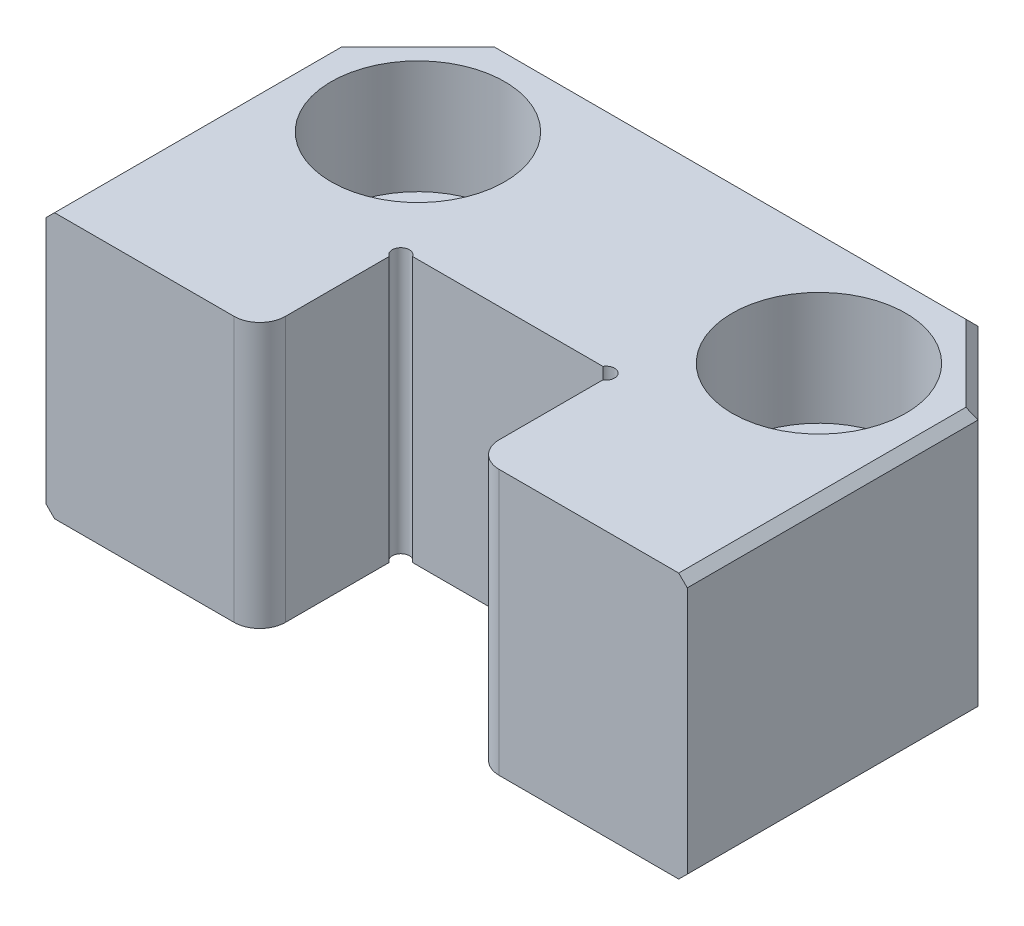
from build123d import *

# Parameters (mm, degrees)
SKETCH2_W          = 38.1
SKETCH2_H          = 22.098
EXTRUDE1_DEPTH     = 15.748
CHAMFER1_SIZE      = 4.826
CUT_EXTRUDE1_DEPTH = 34.154541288
FILLET1_R          = 1.524
SKETCH4_R          = 3.5687
CUT_EXTRUDE2_DEPTH = 15.748
CHAMFER2_SIZE      = 0.508
CUT_EXTRUDE3_START = -15.748
SKETCH5_R          = 5.1562
CUT_EXTRUDE3_DEPTH = 6.731


with BuildPart() as part:
    # Sketch2 → Extrude1 (new body)
    with BuildSketch(Plane(origin=(0, 0, 0), x_dir=(1, 0, 0), z_dir=(0, 1, 0))):
        with Locations((0, 11.049)):
            Rectangle(SKETCH2_W, SKETCH2_H)
    extrude(amount=EXTRUDE1_DEPTH)

    # Chamfer1
    chamfer1_edges = [part.edges().sort_by_distance(p)[0] for p in [
        (-19.05, 7.874, -22.098),
        (19.05, 7.874, -22.098),
    ]]
    chamfer(chamfer1_edges, length=CHAMFER1_SIZE)

    # Sketch3 → Cut-Extrude1 (cut, through all)
    with BuildSketch(Plane.XZ):
        with BuildLine():
            Line((-5.656059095, -8.382), (5.656059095, -8.382))
            ThreePointArc((5.656059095, -8.382), (6.455210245, -8.487210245), (6.35, -7.688059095))
            Line((6.35, -7.688059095), (6.35, 1.27))
            Line((6.35, 1.27), (-6.35, 1.27))
            Line((-6.35, 1.27), (-6.35, -7.688059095))
            ThreePointArc((-6.35, -7.688059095), (-6.455210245, -8.487210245), (-5.656059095, -8.382))
        make_face()
    extrude(amount=-CUT_EXTRUDE1_DEPTH, mode=Mode.SUBTRACT)

    # Fillet1
    fillet1_edges = [part.edges().sort_by_distance(p)[0] for p in [
        (6.35, 7.874, 0),
        (-6.35, 7.874, 0),
    ]]
    fillet(fillet1_edges, radius=FILLET1_R)

    # Sketch4 → Cut-Extrude2 (cut)
    with BuildSketch(Plane.XZ):
        with Locations(Location((11.9126, -14.9606, 0), (0, 0, 270))):
            Circle(SKETCH4_R)
        with Locations(Location((-11.9126, -14.9606, 0), (0, 0, 270))):
            Circle(SKETCH4_R)
    extrude(amount=-CUT_EXTRUDE2_DEPTH, mode=Mode.SUBTRACT)

    # Chamfer2
    chamfer2_edges = [part.edges().sort_by_distance(p)[0] for p in [
        (19.05, 15.748, -8.636),
        (0, 0, -22.098),
        (0, 15.748, -22.098),
        (-19.05, 0, -8.636),
        (-16.637, 0, -19.685),
        (16.637, 0, -19.685),
        (-19.05, 15.748, -8.636),
        (-16.637, 15.748, -19.685),
        (16.637, 15.748, -19.685),
        (19.05, 0, -8.636),
    ]]
    chamfer(chamfer2_edges, length=CHAMFER2_SIZE)

    # Sketch5 → Cut-Extrude3 (cut)
    with BuildSketch(Plane.XZ.offset(CUT_EXTRUDE3_START)):
        with Locations(Location((11.9126, -14.9606, 0), (0, 0, 90))):
            Circle(SKETCH5_R)
        with Locations(Location((-11.9126, -14.9606, 0), (0, 0, 90))):
            Circle(SKETCH5_R)
    extrude(amount=CUT_EXTRUDE3_DEPTH, mode=Mode.SUBTRACT)


solid = part.part
